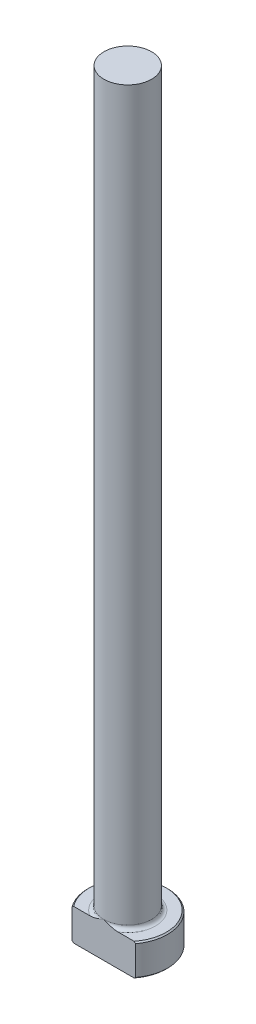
from build123d import *

# Parameters (mm, degrees)
CHAMFER1_SIZE = 0.254
FILLET1_R     = 0.762
KEY_DEPTH     = 153.812852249


with BuildPart() as part:
    # Sketch1 → Revolve1 (revolve)
    with BuildSketch(Plane.XY, mode=Mode.PRIVATE) as revolve1_sk:
        Polygon((0, 0), (-7.9375, 0), (-7.9375, 6.35), (-4.7625, 6.35), (-4.7625, 152.4), (0, 152.4), align=None)
    revolve(revolve1_sk.sketch.rotate(Axis((0, 259.958771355, 0), (0, -1, 0)), 270), axis=Axis((0, 259.958771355, 0), (0, -1, 0)))

    # Chamfer1
    chamfer1_edges = [part.edges().sort_by_distance(p)[0] for p in [
        (0, 6.35, -7.9375),
        (0, 0, -7.9375),
    ]]
    chamfer(chamfer1_edges, length=CHAMFER1_SIZE)

    # Fillet1
    fillet1_edges = [part.edges().sort_by_distance(p)[0] for p in [
        (0, 6.35, -4.7625),
    ]]
    fillet(fillet1_edges, radius=FILLET1_R)

    # Sketch2 → KEY (cut, through all)
    with BuildSketch(Plane.XZ):
        with BuildLine():
            Line((-6.35, 4.7625), (6.35, 4.7625))
            ThreePointArc((6.35, 4.7625), (0, 7.9375), (-6.35, 4.7625))
        make_face()
    extrude(amount=-KEY_DEPTH, mode=Mode.SUBTRACT)


solid = part.part
